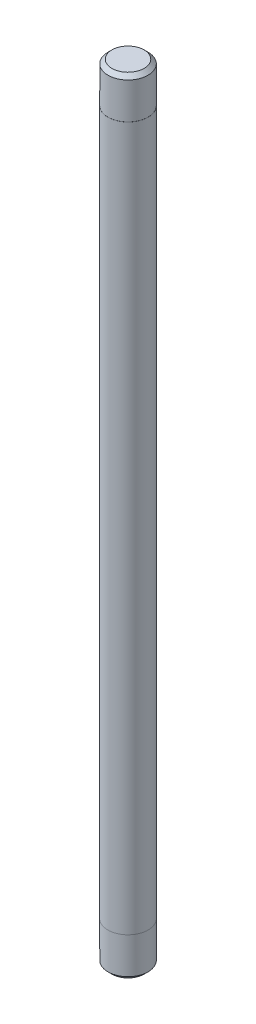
ISO-10303-21;
HEADER;
FILE_DESCRIPTION(('STEP AP214'),'2;1');
FILE_NAME('part.step','',(''),(''),'','','');
FILE_SCHEMA(('AUTOMOTIVE_DESIGN { 1 0 10303 214 1 1 1 1 }'));
ENDSEC;
DATA;
#1=APPLICATION_CONTEXT('core data for automotive mechanical design processes');
#2=APPLICATION_PROTOCOL_DEFINITION('international standard','automotive_design',2000,#1);
#3=PRODUCT_CONTEXT('',#1,'mechanical');
#4=PRODUCT('Part','Part','',(#3));
#5=PRODUCT_RELATED_PRODUCT_CATEGORY('part','',(#4));
#6=PRODUCT_DEFINITION_FORMATION('','',#4);
#7=PRODUCT_DEFINITION_CONTEXT('part definition',#1,'design');
#8=PRODUCT_DEFINITION('design','',#6,#7);
#9=PRODUCT_DEFINITION_SHAPE('','',#8);
#10=(LENGTH_UNIT() NAMED_UNIT(*) SI_UNIT(.MILLI.,.METRE.));
#11=(NAMED_UNIT(*) PLANE_ANGLE_UNIT() SI_UNIT($,.RADIAN.));
#12=(NAMED_UNIT(*) SI_UNIT($,.STERADIAN.) SOLID_ANGLE_UNIT());
#13=UNCERTAINTY_MEASURE_WITH_UNIT(LENGTH_MEASURE(1.E-05),#10,'distance_accuracy_value','');
#14=(GEOMETRIC_REPRESENTATION_CONTEXT(3) GLOBAL_UNCERTAINTY_ASSIGNED_CONTEXT((#13)) GLOBAL_UNIT_ASSIGNED_CONTEXT((#10,
#11,#12)) REPRESENTATION_CONTEXT('',''));
#15=CARTESIAN_POINT('',(0.,0.,0.));
#16=DIRECTION('',(0.,0.,1.));
#17=DIRECTION('',(1.,0.,0.));
#18=AXIS2_PLACEMENT_3D('',#15,#16,#17);
#19=CARTESIAN_POINT('',(0.,78.,0.));
#20=DIRECTION('',(0.,-1.,0.));
#21=DIRECTION('',(0.,0.,-1.));
#22=AXIS2_PLACEMENT_3D('',#19,#20,#21);
#23=CYLINDRICAL_SURFACE('',#22,2.);
#24=CARTESIAN_POINT('',(0.,74.,0.));
#25=DIRECTION('',(0.,1.,0.));
#26=DIRECTION('',(0.,0.,1.));
#27=AXIS2_PLACEMENT_3D('',#24,#25,#26);
#28=CIRCLE('',#27,2.);
#29=CARTESIAN_POINT('',(0.,74.,2.));
#30=VERTEX_POINT('',#29);
#31=EDGE_CURVE('E46',#30,#30,#28,.T.);
#32=ORIENTED_EDGE('',*,*,#31,.F.);
#33=EDGE_LOOP('',(#32));
#34=FACE_BOUND('',#33,.T.);
#35=CARTESIAN_POINT('',(0.,4.,0.));
#36=DIRECTION('',(0.,-1.,0.));
#37=DIRECTION('',(0.,0.,-1.));
#38=AXIS2_PLACEMENT_3D('',#35,#36,#37);
#39=CIRCLE('',#38,2.);
#40=CARTESIAN_POINT('',(0.,4.,-2.));
#41=VERTEX_POINT('',#40);
#42=EDGE_CURVE('E56',#41,#41,#39,.T.);
#43=ORIENTED_EDGE('',*,*,#42,.F.);
#44=EDGE_LOOP('',(#43));
#45=FACE_BOUND('',#44,.T.);
#46=ADVANCED_FACE('F30',(#34,#45),#23,.T.);
#47=CARTESIAN_POINT('',(0.,74.,0.));
#48=DIRECTION('',(0.,1.,0.));
#49=DIRECTION('',(0.,0.,1.));
#50=AXIS2_PLACEMENT_3D('',#47,#48,#49);
#51=PLANE('',#50);
#52=CARTESIAN_POINT('',(0.,74.,0.));
#53=DIRECTION('',(0.,1.,0.));
#54=DIRECTION('',(0.,0.,1.));
#55=AXIS2_PLACEMENT_3D('',#52,#53,#54);
#56=CIRCLE('',#55,1.99);
#57=CARTESIAN_POINT('',(0.,74.,1.99));
#58=VERTEX_POINT('',#57);
#59=EDGE_CURVE('E50',#58,#58,#56,.T.);
#60=ORIENTED_EDGE('',*,*,#59,.F.);
#61=EDGE_LOOP('',(#60));
#62=FACE_BOUND('',#61,.T.);
#63=ORIENTED_EDGE('',*,*,#31,.T.);
#64=EDGE_LOOP('',(#63));
#65=FACE_BOUND('',#64,.T.);
#66=ADVANCED_FACE('F73',(#62,#65),#51,.T.);
#67=CARTESIAN_POINT('',(0.,74.,0.));
#68=DIRECTION('',(0.,1.,0.));
#69=DIRECTION('',(0.,0.,1.));
#70=AXIS2_PLACEMENT_3D('',#67,#68,#69);
#71=CYLINDRICAL_SURFACE('',#70,1.99);
#72=CARTESIAN_POINT('',(0.,77.61,0.));
#73=DIRECTION('',(0.,-1.,0.));
#74=DIRECTION('',(0.,0.,-1.));
#75=AXIS2_PLACEMENT_3D('',#72,#73,#74);
#76=CIRCLE('',#75,1.99);
#77=CARTESIAN_POINT('',(0.,77.61,-1.99));
#78=VERTEX_POINT('',#77);
#79=EDGE_CURVE('E42',#78,#78,#76,.F.);
#80=ORIENTED_EDGE('',*,*,#79,.F.);
#81=EDGE_LOOP('',(#80));
#82=FACE_BOUND('',#81,.T.);
#83=ORIENTED_EDGE('',*,*,#59,.T.);
#84=EDGE_LOOP('',(#83));
#85=FACE_BOUND('',#84,.T.);
#86=ADVANCED_FACE('F78',(#82,#85),#71,.T.);
#87=CARTESIAN_POINT('',(0.,78.,0.));
#88=DIRECTION('',(0.,1.,0.));
#89=DIRECTION('',(0.,0.,1.));
#90=AXIS2_PLACEMENT_3D('',#87,#88,#89);
#91=PLANE('',#90);
#92=CARTESIAN_POINT('',(0.,78.,0.));
#93=DIRECTION('',(0.,1.,0.));
#94=DIRECTION('',(0.,0.,1.));
#95=AXIS2_PLACEMENT_3D('',#92,#93,#94);
#96=CIRCLE('',#95,1.6);
#97=CARTESIAN_POINT('',(0.,78.,1.6));
#98=VERTEX_POINT('',#97);
#99=EDGE_CURVE('E37',#98,#98,#96,.T.);
#100=ORIENTED_EDGE('',*,*,#99,.T.);
#101=EDGE_LOOP('',(#100));
#102=FACE_BOUND('',#101,.T.);
#103=ADVANCED_FACE('F84',(#102),#91,.T.);
#104=CARTESIAN_POINT('',(0.,78.,0.));
#105=DIRECTION('',(0.,-1.,0.));
#106=DIRECTION('',(0.,0.,-1.));
#107=AXIS2_PLACEMENT_3D('',#104,#105,#106);
#108=CONICAL_SURFACE('',#107,1.6,0.785398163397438);
#109=ORIENTED_EDGE('',*,*,#99,.F.);
#110=EDGE_LOOP('',(#109));
#111=FACE_BOUND('',#110,.T.);
#112=ORIENTED_EDGE('',*,*,#79,.T.);
#113=EDGE_LOOP('',(#112));
#114=FACE_BOUND('',#113,.T.);
#115=ADVANCED_FACE('F68',(#111,#114),#108,.T.);
#116=CARTESIAN_POINT('',(0.,4.,0.));
#117=DIRECTION('',(0.,-1.,0.));
#118=DIRECTION('',(0.,0.,-1.));
#119=AXIS2_PLACEMENT_3D('',#116,#117,#118);
#120=PLANE('',#119);
#121=CARTESIAN_POINT('',(0.,4.,0.));
#122=DIRECTION('',(0.,-1.,0.));
#123=DIRECTION('',(0.,0.,-1.));
#124=AXIS2_PLACEMENT_3D('',#121,#122,#123);
#125=CIRCLE('',#124,1.99);
#126=CARTESIAN_POINT('',(0.,4.,-1.99));
#127=VERTEX_POINT('',#126);
#128=EDGE_CURVE('E59',#127,#127,#125,.T.);
#129=ORIENTED_EDGE('',*,*,#128,.F.);
#130=EDGE_LOOP('',(#129));
#131=FACE_BOUND('',#130,.T.);
#132=ORIENTED_EDGE('',*,*,#42,.T.);
#133=EDGE_LOOP('',(#132));
#134=FACE_BOUND('',#133,.T.);
#135=ADVANCED_FACE('F65',(#131,#134),#120,.T.);
#136=CARTESIAN_POINT('',(0.,4.,0.));
#137=DIRECTION('',(0.,-1.,0.));
#138=DIRECTION('',(0.,0.,-1.));
#139=AXIS2_PLACEMENT_3D('',#136,#137,#138);
#140=CYLINDRICAL_SURFACE('',#139,1.99);
#141=CARTESIAN_POINT('',(0.,0.390000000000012,0.));
#142=DIRECTION('',(0.,1.,0.));
#143=DIRECTION('',(0.,0.,1.));
#144=AXIS2_PLACEMENT_3D('',#141,#142,#143);
#145=CIRCLE('',#144,1.99);
#146=CARTESIAN_POINT('',(0.,0.390000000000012,1.99));
#147=VERTEX_POINT('',#146);
#148=EDGE_CURVE('E33',#147,#147,#145,.F.);
#149=ORIENTED_EDGE('',*,*,#148,.F.);
#150=EDGE_LOOP('',(#149));
#151=FACE_BOUND('',#150,.T.);
#152=ORIENTED_EDGE('',*,*,#128,.T.);
#153=EDGE_LOOP('',(#152));
#154=FACE_BOUND('',#153,.T.);
#155=ADVANCED_FACE('F63',(#151,#154),#140,.T.);
#156=CARTESIAN_POINT('',(0.,0.,0.));
#157=DIRECTION('',(0.,1.,0.));
#158=DIRECTION('',(0.,0.,1.));
#159=AXIS2_PLACEMENT_3D('',#156,#157,#158);
#160=PLANE('',#159);
#161=CARTESIAN_POINT('',(0.,0.,0.));
#162=DIRECTION('',(0.,1.,0.));
#163=DIRECTION('',(0.,0.,1.));
#164=AXIS2_PLACEMENT_3D('',#161,#162,#163);
#165=CIRCLE('',#164,1.59999999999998);
#166=CARTESIAN_POINT('',(0.,0.,1.59999999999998));
#167=VERTEX_POINT('',#166);
#168=EDGE_CURVE('E10',#167,#167,#165,.F.);
#169=ORIENTED_EDGE('',*,*,#168,.T.);
#170=EDGE_LOOP('',(#169));
#171=FACE_BOUND('',#170,.T.);
#172=ADVANCED_FACE('F92',(#171),#160,.F.);
#173=CARTESIAN_POINT('',(0.,0.400000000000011,0.));
#174=DIRECTION('',(0.,1.,0.));
#175=DIRECTION('',(0.,0.,1.));
#176=AXIS2_PLACEMENT_3D('',#173,#174,#175);
#177=CONICAL_SURFACE('',#176,2.,0.785398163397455);
#178=ORIENTED_EDGE('',*,*,#168,.F.);
#179=EDGE_LOOP('',(#178));
#180=FACE_BOUND('',#179,.T.);
#181=ORIENTED_EDGE('',*,*,#148,.T.);
#182=EDGE_LOOP('',(#181));
#183=FACE_BOUND('',#182,.T.);
#184=ADVANCED_FACE('F89',(#180,#183),#177,.T.);
#185=CLOSED_SHELL('',(#46,#66,#86,#103,#115,#135,#155,#172,#184));
#186=MANIFOLD_SOLID_BREP('B2',#185);
#187=ADVANCED_BREP_SHAPE_REPRESENTATION('',(#18,#186),#14);
#188=SHAPE_DEFINITION_REPRESENTATION(#9,#187);
ENDSEC;
END-ISO-10303-21;
